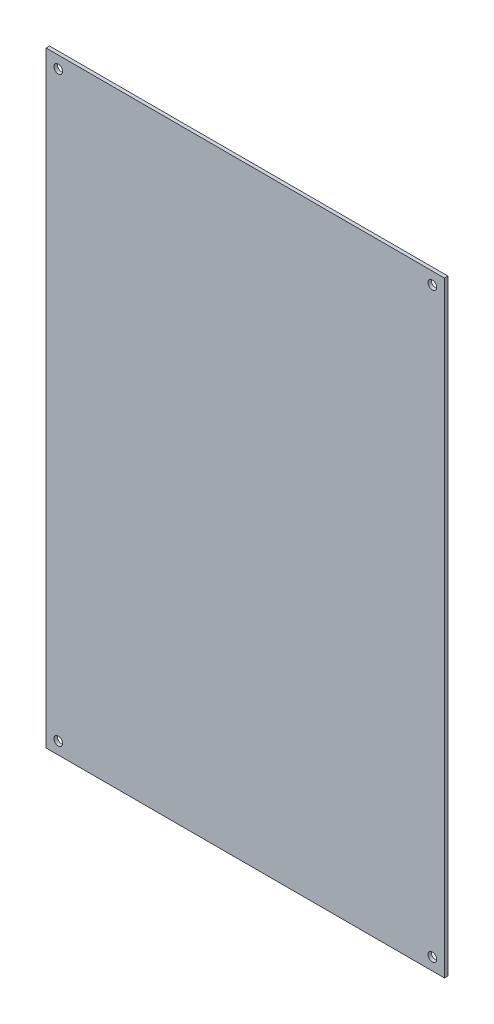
from build123d import *

# Parameters (mm, degrees)
ESQUISSE1_W      = 230
ESQUISSE1_H      = 350
ESQUISSE1_R      = 2.5
EXTRUSION1_DEPTH = 2


with BuildPart() as part:
    # Esquisse1 → Extrusion1 (new body)
    with BuildSketch(Plane.XY):
        with Locations((108, -168)):
            Rectangle(ESQUISSE1_W, ESQUISSE1_H)
        Circle(ESQUISSE1_R, mode=Mode.SUBTRACT)
        with Locations((216, 0)):
            Circle(ESQUISSE1_R, mode=Mode.SUBTRACT)
        with Locations((216, -336)):
            Circle(ESQUISSE1_R, mode=Mode.SUBTRACT)
        with Locations((0, -336)):
            Circle(ESQUISSE1_R, mode=Mode.SUBTRACT)
    extrude(amount=EXTRUSION1_DEPTH)


solid = part.part
